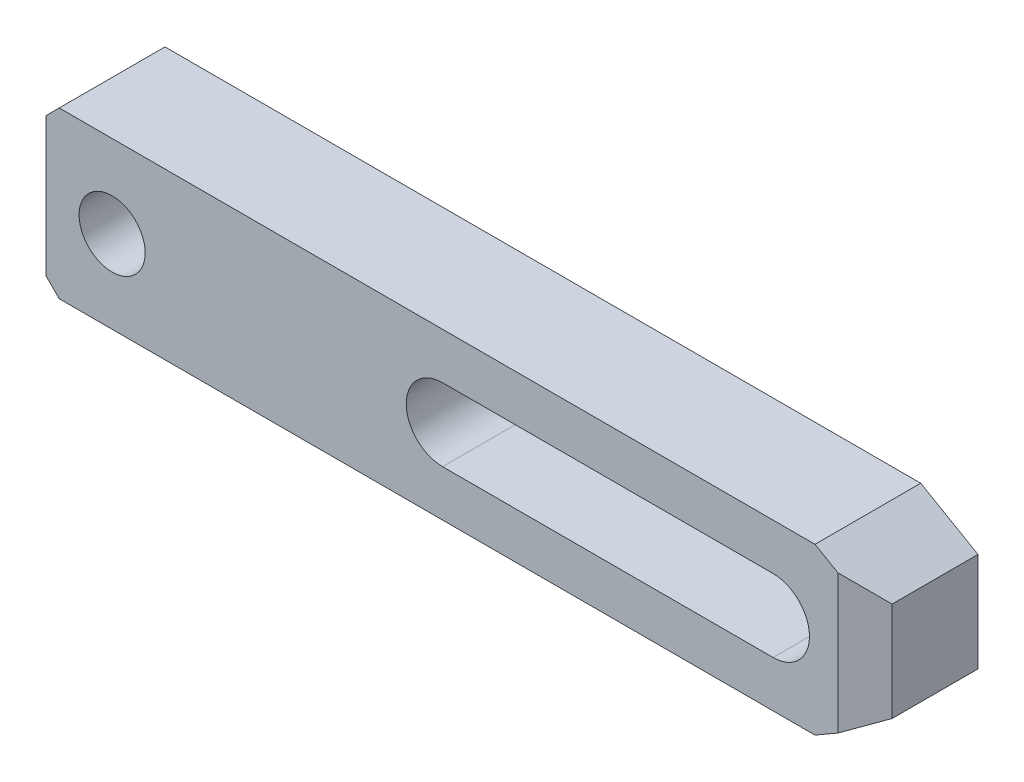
ISO-10303-21;
HEADER;
FILE_DESCRIPTION(('STEP AP214'),'2;1');
FILE_NAME('part.step','',(''),(''),'','','');
FILE_SCHEMA(('AUTOMOTIVE_DESIGN { 1 0 10303 214 1 1 1 1 }'));
ENDSEC;
DATA;
#1=APPLICATION_CONTEXT('core data for automotive mechanical design processes');
#2=APPLICATION_PROTOCOL_DEFINITION('international standard','automotive_design',2000,#1);
#3=PRODUCT_CONTEXT('',#1,'mechanical');
#4=PRODUCT('Part','Part','',(#3));
#5=PRODUCT_RELATED_PRODUCT_CATEGORY('part','',(#4));
#6=PRODUCT_DEFINITION_FORMATION('','',#4);
#7=PRODUCT_DEFINITION_CONTEXT('part definition',#1,'design');
#8=PRODUCT_DEFINITION('design','',#6,#7);
#9=PRODUCT_DEFINITION_SHAPE('','',#8);
#10=(LENGTH_UNIT() NAMED_UNIT(*) SI_UNIT(.MILLI.,.METRE.));
#11=(NAMED_UNIT(*) PLANE_ANGLE_UNIT() SI_UNIT($,.RADIAN.));
#12=(NAMED_UNIT(*) SI_UNIT($,.STERADIAN.) SOLID_ANGLE_UNIT());
#13=UNCERTAINTY_MEASURE_WITH_UNIT(LENGTH_MEASURE(1.E-05),#10,'distance_accuracy_value','');
#14=(GEOMETRIC_REPRESENTATION_CONTEXT(3) GLOBAL_UNCERTAINTY_ASSIGNED_CONTEXT((#13)) GLOBAL_UNIT_ASSIGNED_CONTEXT((#10,
#11,#12)) REPRESENTATION_CONTEXT('',''));
#15=CARTESIAN_POINT('',(0.,0.,0.));
#16=DIRECTION('',(0.,0.,1.));
#17=DIRECTION('',(1.,0.,0.));
#18=AXIS2_PLACEMENT_3D('',#15,#16,#17);
#19=CARTESIAN_POINT('',(-66.1487483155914,54.3512516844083,0.));
#20=DIRECTION('',(0.,0.,1.));
#21=DIRECTION('',(-1.,0.,0.));
#22=AXIS2_PLACEMENT_3D('',#19,#20,#21);
#23=PLANE('',#22);
#24=DIRECTION('',(0.,1.,0.));
#25=VECTOR('',#24,1.);
#26=CARTESIAN_POINT('',(-110.,-10.5,0.));
#27=LINE('',#26,#25);
#28=CARTESIAN_POINT('',(-110.,-10.5,0.));
#29=VERTEX_POINT('',#28);
#30=CARTESIAN_POINT('',(-110.,-5.5,0.));
#31=VERTEX_POINT('',#30);
#32=EDGE_CURVE('E147',#29,#31,#27,.T.);
#33=ORIENTED_EDGE('',*,*,#32,.T.);
#34=DIRECTION('',(-1.,0.,0.));
#35=VECTOR('',#34,1.);
#36=CARTESIAN_POINT('',(0.,-5.5,0.));
#37=LINE('',#36,#35);
#38=CARTESIAN_POINT('',(0.,-5.5,0.));
#39=VERTEX_POINT('',#38);
#40=EDGE_CURVE('E237',#39,#31,#37,.T.);
#41=ORIENTED_EDGE('',*,*,#40,.F.);
#42=CARTESIAN_POINT('',(0.,0.,0.));
#43=DIRECTION('',(0.,0.,1.));
#44=DIRECTION('',(-1.,0.,0.));
#45=AXIS2_PLACEMENT_3D('',#42,#43,#44);
#46=CIRCLE('',#45,5.5);
#47=CARTESIAN_POINT('',(0.,5.5,0.));
#48=VERTEX_POINT('',#47);
#49=EDGE_CURVE('E128',#39,#48,#46,.T.);
#50=ORIENTED_EDGE('',*,*,#49,.T.);
#51=DIRECTION('',(1.,0.,0.));
#52=VECTOR('',#51,1.);
#53=CARTESIAN_POINT('',(-50.,5.5,0.));
#54=LINE('',#53,#52);
#55=CARTESIAN_POINT('',(-110.,5.5,0.));
#56=VERTEX_POINT('',#55);
#57=EDGE_CURVE('E119',#56,#48,#54,.T.);
#58=ORIENTED_EDGE('',*,*,#57,.F.);
#59=CARTESIAN_POINT('',(-110.,10.5,0.));
#60=VERTEX_POINT('',#59);
#61=EDGE_CURVE('E124',#56,#60,#27,.T.);
#62=ORIENTED_EDGE('',*,*,#61,.T.);
#63=DIRECTION('',(-0.70710678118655,-0.707106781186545,0.));
#64=VECTOR('',#63,1.);
#65=CARTESIAN_POINT('',(-108.,12.5,0.));
#66=LINE('',#65,#64);
#67=CARTESIAN_POINT('',(-108.,12.5,0.));
#68=VERTEX_POINT('',#67);
#69=EDGE_CURVE('E148',#68,#60,#66,.T.);
#70=ORIENTED_EDGE('',*,*,#69,.F.);
#71=DIRECTION('',(-1.,0.,0.));
#72=VECTOR('',#71,1.);
#73=CARTESIAN_POINT('',(6.3397459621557,12.5,0.));
#74=LINE('',#73,#72);
#75=CARTESIAN_POINT('',(6.3397459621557,12.5,0.));
#76=VERTEX_POINT('',#75);
#77=EDGE_CURVE('E151',#76,#68,#74,.T.);
#78=ORIENTED_EDGE('',*,*,#77,.F.);
#79=DIRECTION('',(-0.866025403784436,0.5,0.));
#80=VECTOR('',#79,1.);
#81=CARTESIAN_POINT('',(15.,7.5,0.));
#82=LINE('',#81,#80);
#83=CARTESIAN_POINT('',(15.,7.5,0.));
#84=VERTEX_POINT('',#83);
#85=EDGE_CURVE('E158',#84,#76,#82,.T.);
#86=ORIENTED_EDGE('',*,*,#85,.F.);
#87=DIRECTION('',(0.,-1.,0.));
#88=VECTOR('',#87,1.);
#89=CARTESIAN_POINT('',(15.,7.5,0.));
#90=LINE('',#89,#88);
#91=CARTESIAN_POINT('',(15.,-7.5,0.));
#92=VERTEX_POINT('',#91);
#93=EDGE_CURVE('E181',#84,#92,#90,.T.);
#94=ORIENTED_EDGE('',*,*,#93,.T.);
#95=DIRECTION('',(-0.86602540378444,-0.5,0.));
#96=VECTOR('',#95,1.);
#97=CARTESIAN_POINT('',(15.,-7.5,0.));
#98=LINE('',#97,#96);
#99=CARTESIAN_POINT('',(6.33974596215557,-12.5,0.));
#100=VERTEX_POINT('',#99);
#101=EDGE_CURVE('E208',#92,#100,#98,.T.);
#102=ORIENTED_EDGE('',*,*,#101,.T.);
#103=DIRECTION('',(-1.,0.,0.));
#104=VECTOR('',#103,1.);
#105=CARTESIAN_POINT('',(6.33974596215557,-12.5,0.));
#106=LINE('',#105,#104);
#107=CARTESIAN_POINT('',(-108.,-12.5,0.));
#108=VERTEX_POINT('',#107);
#109=EDGE_CURVE('E210',#100,#108,#106,.T.);
#110=ORIENTED_EDGE('',*,*,#109,.T.);
#111=DIRECTION('',(-0.707106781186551,0.707106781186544,0.));
#112=VECTOR('',#111,1.);
#113=CARTESIAN_POINT('',(-108.,-12.5,0.));
#114=LINE('',#113,#112);
#115=EDGE_CURVE('E150',#108,#29,#114,.T.);
#116=ORIENTED_EDGE('',*,*,#115,.T.);
#117=EDGE_LOOP('',(#33,#41,#50,#58,#62,#70,#78,#86,#94,#102,#110,#116));
#118=FACE_BOUND('',#117,.T.);
#119=ADVANCED_FACE('F14',(#118),#23,.F.);
#120=CARTESIAN_POINT('',(-110.,-10.5,16.));
#121=DIRECTION('',(-1.,0.,0.));
#122=DIRECTION('',(0.,0.,-1.));
#123=AXIS2_PLACEMENT_3D('',#120,#121,#122);
#124=PLANE('',#123);
#125=DIRECTION('',(0.,-1.,0.));
#126=VECTOR('',#125,1.);
#127=CARTESIAN_POINT('',(-110.,-10.5,5.));
#128=LINE('',#127,#126);
#129=CARTESIAN_POINT('',(-110.,5.5,5.));
#130=VERTEX_POINT('',#129);
#131=CARTESIAN_POINT('',(-110.,-5.5,5.));
#132=VERTEX_POINT('',#131);
#133=EDGE_CURVE('E141',#130,#132,#128,.T.);
#134=ORIENTED_EDGE('',*,*,#133,.T.);
#135=DIRECTION('',(0.,0.,-1.));
#136=VECTOR('',#135,1.);
#137=CARTESIAN_POINT('',(-110.,-5.5,16.));
#138=LINE('',#137,#136);
#139=EDGE_CURVE('E140',#132,#31,#138,.T.);
#140=ORIENTED_EDGE('',*,*,#139,.T.);
#141=ORIENTED_EDGE('',*,*,#32,.F.);
#142=DIRECTION('',(0.,0.,-1.));
#143=VECTOR('',#142,1.);
#144=CARTESIAN_POINT('',(-110.,-10.5,16.));
#145=LINE('',#144,#143);
#146=CARTESIAN_POINT('',(-110.,-10.5,16.));
#147=VERTEX_POINT('',#146);
#148=EDGE_CURVE('E189',#147,#29,#145,.T.);
#149=ORIENTED_EDGE('',*,*,#148,.F.);
#150=DIRECTION('',(0.,1.,0.));
#151=VECTOR('',#150,1.);
#152=CARTESIAN_POINT('',(-110.,-10.5,16.));
#153=LINE('',#152,#151);
#154=CARTESIAN_POINT('',(-110.,10.5,16.));
#155=VERTEX_POINT('',#154);
#156=EDGE_CURVE('E171',#147,#155,#153,.T.);
#157=ORIENTED_EDGE('',*,*,#156,.T.);
#158=DIRECTION('',(0.,0.,-1.));
#159=VECTOR('',#158,1.);
#160=CARTESIAN_POINT('',(-110.,10.5,16.));
#161=LINE('',#160,#159);
#162=EDGE_CURVE('E145',#155,#60,#161,.T.);
#163=ORIENTED_EDGE('',*,*,#162,.T.);
#164=ORIENTED_EDGE('',*,*,#61,.F.);
#165=DIRECTION('',(0.,0.,-1.));
#166=VECTOR('',#165,1.);
#167=CARTESIAN_POINT('',(-110.,5.5,16.));
#168=LINE('',#167,#166);
#169=EDGE_CURVE('E135',#130,#56,#168,.T.);
#170=ORIENTED_EDGE('',*,*,#169,.F.);
#171=EDGE_LOOP('',(#134,#140,#141,#149,#157,#163,#164,#170));
#172=FACE_BOUND('',#171,.T.);
#173=ADVANCED_FACE('F143',(#172),#124,.T.);
#174=CARTESIAN_POINT('',(-100.,0.,16.));
#175=DIRECTION('',(0.,0.,-1.));
#176=DIRECTION('',(1.,0.,0.));
#177=AXIS2_PLACEMENT_3D('',#174,#175,#176);
#178=CYLINDRICAL_SURFACE('',#177,5.);
#179=CARTESIAN_POINT('',(-100.,0.,16.));
#180=DIRECTION('',(0.,0.,1.));
#181=DIRECTION('',(-1.,0.,0.));
#182=AXIS2_PLACEMENT_3D('',#179,#180,#181);
#183=CIRCLE('',#182,5.);
#184=CARTESIAN_POINT('',(-105.,0.,16.));
#185=VERTEX_POINT('',#184);
#186=EDGE_CURVE('E161',#185,#185,#183,.T.);
#187=ORIENTED_EDGE('',*,*,#186,.T.);
#188=EDGE_LOOP('',(#187));
#189=FACE_BOUND('',#188,.T.);
#190=CARTESIAN_POINT('',(-100.,0.,5.));
#191=DIRECTION('',(0.,0.,-1.));
#192=DIRECTION('',(1.,0.,0.));
#193=AXIS2_PLACEMENT_3D('',#190,#191,#192);
#194=CIRCLE('',#193,5.);
#195=CARTESIAN_POINT('',(-95.,0.,5.));
#196=VERTEX_POINT('',#195);
#197=EDGE_CURVE('E425',#196,#196,#194,.T.);
#198=ORIENTED_EDGE('',*,*,#197,.T.);
#199=EDGE_LOOP('',(#198));
#200=FACE_BOUND('',#199,.T.);
#201=ADVANCED_FACE('F262',(#189,#200),#178,.F.);
#202=CARTESIAN_POINT('',(-50.,0.,16.));
#203=DIRECTION('',(0.,0.,-1.));
#204=DIRECTION('',(1.,0.,0.));
#205=AXIS2_PLACEMENT_3D('',#202,#203,#204);
#206=CYLINDRICAL_SURFACE('',#205,5.5);
#207=DIRECTION('',(0.,0.,-1.));
#208=VECTOR('',#207,1.);
#209=CARTESIAN_POINT('',(-50.,-5.5,16.));
#210=LINE('',#209,#208);
#211=CARTESIAN_POINT('',(-50.,-5.5,16.));
#212=VERTEX_POINT('',#211);
#213=CARTESIAN_POINT('',(-50.,-5.5,5.));
#214=VERTEX_POINT('',#213);
#215=EDGE_CURVE('E256',#212,#214,#210,.T.);
#216=ORIENTED_EDGE('',*,*,#215,.T.);
#217=CARTESIAN_POINT('',(-50.,0.,5.));
#218=DIRECTION('',(0.,0.,-1.));
#219=DIRECTION('',(1.,0.,0.));
#220=AXIS2_PLACEMENT_3D('',#217,#218,#219);
#221=CIRCLE('',#220,5.5);
#222=CARTESIAN_POINT('',(-50.,5.5,5.));
#223=VERTEX_POINT('',#222);
#224=EDGE_CURVE('E278',#214,#223,#221,.T.);
#225=ORIENTED_EDGE('',*,*,#224,.T.);
#226=DIRECTION('',(0.,0.,-1.));
#227=VECTOR('',#226,1.);
#228=CARTESIAN_POINT('',(-50.,5.5,16.));
#229=LINE('',#228,#227);
#230=CARTESIAN_POINT('',(-50.,5.5,16.));
#231=VERTEX_POINT('',#230);
#232=EDGE_CURVE('E244',#231,#223,#229,.T.);
#233=ORIENTED_EDGE('',*,*,#232,.F.);
#234=CARTESIAN_POINT('',(-50.,0.,16.));
#235=DIRECTION('',(0.,0.,1.));
#236=DIRECTION('',(-1.,0.,0.));
#237=AXIS2_PLACEMENT_3D('',#234,#235,#236);
#238=CIRCLE('',#237,5.5);
#239=EDGE_CURVE('E132',#231,#212,#238,.T.);
#240=ORIENTED_EDGE('',*,*,#239,.T.);
#241=EDGE_LOOP('',(#216,#225,#233,#240));
#242=FACE_BOUND('',#241,.T.);
#243=ADVANCED_FACE('F269',(#242),#206,.F.);
#244=CARTESIAN_POINT('',(-66.1487483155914,54.3512516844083,16.));
#245=DIRECTION('',(0.,0.,1.));
#246=DIRECTION('',(-1.,0.,0.));
#247=AXIS2_PLACEMENT_3D('',#244,#245,#246);
#248=PLANE('',#247);
#249=DIRECTION('',(0.,-1.,0.));
#250=VECTOR('',#249,1.);
#251=CARTESIAN_POINT('',(9.80384757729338,54.3512516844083,16.));
#252=LINE('',#251,#250);
#253=CARTESIAN_POINT('',(9.80384757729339,10.5,16.));
#254=VERTEX_POINT('',#253);
#255=CARTESIAN_POINT('',(9.80384757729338,-10.5,16.));
#256=VERTEX_POINT('',#255);
#257=EDGE_CURVE('E233',#254,#256,#252,.T.);
#258=ORIENTED_EDGE('',*,*,#257,.F.);
#259=DIRECTION('',(-0.866025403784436,0.5,0.));
#260=VECTOR('',#259,1.);
#261=CARTESIAN_POINT('',(15.,7.5,16.));
#262=LINE('',#261,#260);
#263=CARTESIAN_POINT('',(6.3397459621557,12.5,16.));
#264=VERTEX_POINT('',#263);
#265=EDGE_CURVE('E179',#254,#264,#262,.T.);
#266=ORIENTED_EDGE('',*,*,#265,.T.);
#267=DIRECTION('',(-1.,0.,0.));
#268=VECTOR('',#267,1.);
#269=CARTESIAN_POINT('',(6.3397459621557,12.5,16.));
#270=LINE('',#269,#268);
#271=CARTESIAN_POINT('',(-108.,12.5,16.));
#272=VERTEX_POINT('',#271);
#273=EDGE_CURVE('E176',#264,#272,#270,.T.);
#274=ORIENTED_EDGE('',*,*,#273,.T.);
#275=DIRECTION('',(-0.70710678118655,-0.707106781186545,0.));
#276=VECTOR('',#275,1.);
#277=CARTESIAN_POINT('',(-108.,12.5,16.));
#278=LINE('',#277,#276);
#279=EDGE_CURVE('E173',#272,#155,#278,.T.);
#280=ORIENTED_EDGE('',*,*,#279,.T.);
#281=ORIENTED_EDGE('',*,*,#156,.F.);
#282=DIRECTION('',(-0.707106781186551,0.707106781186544,0.));
#283=VECTOR('',#282,1.);
#284=CARTESIAN_POINT('',(-108.,-12.5,16.));
#285=LINE('',#284,#283);
#286=CARTESIAN_POINT('',(-108.,-12.5,16.));
#287=VERTEX_POINT('',#286);
#288=EDGE_CURVE('E168',#287,#147,#285,.T.);
#289=ORIENTED_EDGE('',*,*,#288,.F.);
#290=DIRECTION('',(-1.,0.,0.));
#291=VECTOR('',#290,1.);
#292=CARTESIAN_POINT('',(6.33974596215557,-12.5,16.));
#293=LINE('',#292,#291);
#294=CARTESIAN_POINT('',(6.33974596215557,-12.5,16.));
#295=VERTEX_POINT('',#294);
#296=EDGE_CURVE('E165',#295,#287,#293,.T.);
#297=ORIENTED_EDGE('',*,*,#296,.F.);
#298=DIRECTION('',(-0.86602540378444,-0.5,0.));
#299=VECTOR('',#298,1.);
#300=CARTESIAN_POINT('',(15.,-7.5,16.));
#301=LINE('',#300,#299);
#302=EDGE_CURVE('E162',#256,#295,#301,.T.);
#303=ORIENTED_EDGE('',*,*,#302,.F.);
#304=EDGE_LOOP('',(#258,#266,#274,#280,#281,#289,#297,#303));
#305=FACE_BOUND('',#304,.T.);
#306=ORIENTED_EDGE('',*,*,#186,.F.);
#307=EDGE_LOOP('',(#306));
#308=FACE_BOUND('',#307,.T.);
#309=DIRECTION('',(-1.,0.,0.));
#310=VECTOR('',#309,1.);
#311=CARTESIAN_POINT('',(0.,-5.5,16.));
#312=LINE('',#311,#310);
#313=CARTESIAN_POINT('',(0.,-5.5,16.));
#314=VERTEX_POINT('',#313);
#315=EDGE_CURVE('E247',#314,#212,#312,.T.);
#316=ORIENTED_EDGE('',*,*,#315,.T.);
#317=ORIENTED_EDGE('',*,*,#239,.F.);
#318=DIRECTION('',(1.,0.,0.));
#319=VECTOR('',#318,1.);
#320=CARTESIAN_POINT('',(-50.,5.5,16.));
#321=LINE('',#320,#319);
#322=CARTESIAN_POINT('',(0.,5.5,16.));
#323=VERTEX_POINT('',#322);
#324=EDGE_CURVE('E241',#231,#323,#321,.T.);
#325=ORIENTED_EDGE('',*,*,#324,.T.);
#326=CARTESIAN_POINT('',(0.,0.,16.));
#327=DIRECTION('',(0.,0.,1.));
#328=DIRECTION('',(-1.,0.,0.));
#329=AXIS2_PLACEMENT_3D('',#326,#327,#328);
#330=CIRCLE('',#329,5.5);
#331=EDGE_CURVE('E245',#314,#323,#330,.T.);
#332=ORIENTED_EDGE('',*,*,#331,.F.);
#333=EDGE_LOOP('',(#316,#317,#325,#332));
#334=FACE_BOUND('',#333,.T.);
#335=ADVANCED_FACE('F265',(#305,#308,#334),#248,.T.);
#336=CARTESIAN_POINT('',(15.,7.5,16.));
#337=DIRECTION('',(-0.5,-0.866025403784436,0.));
#338=DIRECTION('',(0.866025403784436,-0.5,0.));
#339=AXIS2_PLACEMENT_3D('',#336,#337,#338);
#340=PLANE('',#339);
#341=ORIENTED_EDGE('',*,*,#265,.F.);
#342=DIRECTION('',(0.774596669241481,-0.447213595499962,-0.447213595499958));
#343=VECTOR('',#342,1.);
#344=CARTESIAN_POINT('',(13.9607695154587,8.1,13.6));
#345=LINE('',#344,#343);
#346=CARTESIAN_POINT('',(15.,7.5,13.));
#347=VERTEX_POINT('',#346);
#348=EDGE_CURVE('E235',#254,#347,#345,.T.);
#349=ORIENTED_EDGE('',*,*,#348,.T.);
#350=DIRECTION('',(0.,0.,-1.));
#351=VECTOR('',#350,1.);
#352=CARTESIAN_POINT('',(15.,7.5,16.));
#353=LINE('',#352,#351);
#354=EDGE_CURVE('E164',#347,#84,#353,.T.);
#355=ORIENTED_EDGE('',*,*,#354,.T.);
#356=ORIENTED_EDGE('',*,*,#85,.T.);
#357=DIRECTION('',(0.,0.,-1.));
#358=VECTOR('',#357,1.);
#359=CARTESIAN_POINT('',(6.3397459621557,12.5,16.));
#360=LINE('',#359,#358);
#361=EDGE_CURVE('E9',#264,#76,#360,.T.);
#362=ORIENTED_EDGE('',*,*,#361,.F.);
#363=EDGE_LOOP('',(#341,#349,#355,#356,#362));
#364=FACE_BOUND('',#363,.T.);
#365=ADVANCED_FACE('F268',(#364),#340,.F.);
#366=CARTESIAN_POINT('',(6.3397459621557,12.5,16.));
#367=DIRECTION('',(0.,-1.,0.));
#368=DIRECTION('',(0.,0.,1.));
#369=AXIS2_PLACEMENT_3D('',#366,#367,#368);
#370=PLANE('',#369);
#371=DIRECTION('',(0.,0.,-1.));
#372=VECTOR('',#371,1.);
#373=CARTESIAN_POINT('',(-108.,12.5,16.));
#374=LINE('',#373,#372);
#375=EDGE_CURVE('E22',#272,#68,#374,.T.);
#376=ORIENTED_EDGE('',*,*,#375,.F.);
#377=ORIENTED_EDGE('',*,*,#273,.F.);
#378=ORIENTED_EDGE('',*,*,#361,.T.);
#379=ORIENTED_EDGE('',*,*,#77,.T.);
#380=EDGE_LOOP('',(#376,#377,#378,#379));
#381=FACE_BOUND('',#380,.T.);
#382=ADVANCED_FACE('F16',(#381),#370,.F.);
#383=CARTESIAN_POINT('',(-108.,12.5,16.));
#384=DIRECTION('',(0.707106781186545,-0.70710678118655,0.));
#385=DIRECTION('',(0.70710678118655,0.707106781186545,0.));
#386=AXIS2_PLACEMENT_3D('',#383,#384,#385);
#387=PLANE('',#386);
#388=ORIENTED_EDGE('',*,*,#162,.F.);
#389=ORIENTED_EDGE('',*,*,#279,.F.);
#390=ORIENTED_EDGE('',*,*,#375,.T.);
#391=ORIENTED_EDGE('',*,*,#69,.T.);
#392=EDGE_LOOP('',(#388,#389,#390,#391));
#393=FACE_BOUND('',#392,.T.);
#394=ADVANCED_FACE('F193',(#393),#387,.F.);
#395=CARTESIAN_POINT('',(-108.,-12.5,16.));
#396=DIRECTION('',(-0.707106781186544,-0.707106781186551,0.));
#397=DIRECTION('',(0.707106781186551,-0.707106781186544,0.));
#398=AXIS2_PLACEMENT_3D('',#395,#396,#397);
#399=PLANE('',#398);
#400=DIRECTION('',(0.,0.,-1.));
#401=VECTOR('',#400,1.);
#402=CARTESIAN_POINT('',(-108.,-12.5,16.));
#403=LINE('',#402,#401);
#404=EDGE_CURVE('E187',#287,#108,#403,.T.);
#405=ORIENTED_EDGE('',*,*,#404,.F.);
#406=ORIENTED_EDGE('',*,*,#288,.T.);
#407=ORIENTED_EDGE('',*,*,#148,.T.);
#408=ORIENTED_EDGE('',*,*,#115,.F.);
#409=EDGE_LOOP('',(#405,#406,#407,#408));
#410=FACE_BOUND('',#409,.T.);
#411=ADVANCED_FACE('F220',(#410),#399,.T.);
#412=CARTESIAN_POINT('',(6.33974596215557,-12.5,16.));
#413=DIRECTION('',(0.,-1.,0.));
#414=DIRECTION('',(0.,0.,1.));
#415=AXIS2_PLACEMENT_3D('',#412,#413,#414);
#416=PLANE('',#415);
#417=DIRECTION('',(0.,0.,-1.));
#418=VECTOR('',#417,1.);
#419=CARTESIAN_POINT('',(6.33974596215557,-12.5,16.));
#420=LINE('',#419,#418);
#421=EDGE_CURVE('E185',#295,#100,#420,.T.);
#422=ORIENTED_EDGE('',*,*,#421,.F.);
#423=ORIENTED_EDGE('',*,*,#296,.T.);
#424=ORIENTED_EDGE('',*,*,#404,.T.);
#425=ORIENTED_EDGE('',*,*,#109,.F.);
#426=EDGE_LOOP('',(#422,#423,#424,#425));
#427=FACE_BOUND('',#426,.T.);
#428=ADVANCED_FACE('F306',(#427),#416,.T.);
#429=CARTESIAN_POINT('',(15.,-7.5,16.));
#430=DIRECTION('',(0.5,-0.86602540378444,0.));
#431=DIRECTION('',(0.86602540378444,0.5,0.));
#432=AXIS2_PLACEMENT_3D('',#429,#430,#431);
#433=PLANE('',#432);
#434=DIRECTION('',(0.774596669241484,0.447213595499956,-0.44721359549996));
#435=VECTOR('',#434,1.);
#436=CARTESIAN_POINT('',(13.9607695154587,-8.1,13.6));
#437=LINE('',#436,#435);
#438=CARTESIAN_POINT('',(15.,-7.5,13.));
#439=VERTEX_POINT('',#438);
#440=EDGE_CURVE('E37',#256,#439,#437,.T.);
#441=ORIENTED_EDGE('',*,*,#440,.F.);
#442=ORIENTED_EDGE('',*,*,#302,.T.);
#443=ORIENTED_EDGE('',*,*,#421,.T.);
#444=ORIENTED_EDGE('',*,*,#101,.F.);
#445=DIRECTION('',(0.,0.,-1.));
#446=VECTOR('',#445,1.);
#447=CARTESIAN_POINT('',(15.,-7.5,16.));
#448=LINE('',#447,#446);
#449=EDGE_CURVE('E183',#439,#92,#448,.T.);
#450=ORIENTED_EDGE('',*,*,#449,.F.);
#451=EDGE_LOOP('',(#441,#442,#443,#444,#450));
#452=FACE_BOUND('',#451,.T.);
#453=ADVANCED_FACE('F303',(#452),#433,.T.);
#454=CARTESIAN_POINT('',(15.,7.5,16.));
#455=DIRECTION('',(1.,0.,0.));
#456=DIRECTION('',(0.,0.,1.));
#457=AXIS2_PLACEMENT_3D('',#454,#455,#456);
#458=PLANE('',#457);
#459=DIRECTION('',(0.,-1.,0.));
#460=VECTOR('',#459,1.);
#461=CARTESIAN_POINT('',(15.,20.,13.));
#462=LINE('',#461,#460);
#463=EDGE_CURVE('E227',#347,#439,#462,.T.);
#464=ORIENTED_EDGE('',*,*,#463,.T.);
#465=ORIENTED_EDGE('',*,*,#449,.T.);
#466=ORIENTED_EDGE('',*,*,#93,.F.);
#467=ORIENTED_EDGE('',*,*,#354,.F.);
#468=EDGE_LOOP('',(#464,#465,#466,#467));
#469=FACE_BOUND('',#468,.T.);
#470=ADVANCED_FACE('F205',(#469),#458,.T.);
#471=CARTESIAN_POINT('',(0.,-5.5,16.));
#472=DIRECTION('',(0.,-1.,0.));
#473=DIRECTION('',(1.,0.,0.));
#474=AXIS2_PLACEMENT_3D('',#471,#472,#473);
#475=PLANE('',#474);
#476=ORIENTED_EDGE('',*,*,#40,.T.);
#477=ORIENTED_EDGE('',*,*,#139,.F.);
#478=DIRECTION('',(1.,0.,0.));
#479=VECTOR('',#478,1.);
#480=CARTESIAN_POINT('',(-115.,-5.5,5.));
#481=LINE('',#480,#479);
#482=EDGE_CURVE('E276',#132,#214,#481,.T.);
#483=ORIENTED_EDGE('',*,*,#482,.T.);
#484=ORIENTED_EDGE('',*,*,#215,.F.);
#485=ORIENTED_EDGE('',*,*,#315,.F.);
#486=DIRECTION('',(0.,0.,-1.));
#487=VECTOR('',#486,1.);
#488=CARTESIAN_POINT('',(0.,-5.5,16.));
#489=LINE('',#488,#487);
#490=EDGE_CURVE('E255',#314,#39,#489,.T.);
#491=ORIENTED_EDGE('',*,*,#490,.T.);
#492=EDGE_LOOP('',(#476,#477,#483,#484,#485,#491));
#493=FACE_BOUND('',#492,.T.);
#494=ADVANCED_FACE('F275',(#493),#475,.F.);
#495=CARTESIAN_POINT('',(0.,0.,16.));
#496=DIRECTION('',(0.,0.,-1.));
#497=DIRECTION('',(1.,0.,0.));
#498=AXIS2_PLACEMENT_3D('',#495,#496,#497);
#499=CYLINDRICAL_SURFACE('',#498,5.5);
#500=DIRECTION('',(0.,0.,-1.));
#501=VECTOR('',#500,1.);
#502=CARTESIAN_POINT('',(0.,5.5,16.));
#503=LINE('',#502,#501);
#504=EDGE_CURVE('E253',#323,#48,#503,.T.);
#505=ORIENTED_EDGE('',*,*,#504,.T.);
#506=ORIENTED_EDGE('',*,*,#49,.F.);
#507=ORIENTED_EDGE('',*,*,#490,.F.);
#508=ORIENTED_EDGE('',*,*,#331,.T.);
#509=EDGE_LOOP('',(#505,#506,#507,#508));
#510=FACE_BOUND('',#509,.T.);
#511=ADVANCED_FACE('F280',(#510),#499,.F.);
#512=CARTESIAN_POINT('',(-50.,5.5,16.));
#513=DIRECTION('',(0.,1.,0.));
#514=DIRECTION('',(0.,0.,-1.));
#515=AXIS2_PLACEMENT_3D('',#512,#513,#514);
#516=PLANE('',#515);
#517=ORIENTED_EDGE('',*,*,#57,.T.);
#518=ORIENTED_EDGE('',*,*,#504,.F.);
#519=ORIENTED_EDGE('',*,*,#324,.F.);
#520=ORIENTED_EDGE('',*,*,#232,.T.);
#521=DIRECTION('',(1.,0.,0.));
#522=VECTOR('',#521,1.);
#523=CARTESIAN_POINT('',(-115.,5.5,5.));
#524=LINE('',#523,#522);
#525=EDGE_CURVE('E29',#130,#223,#524,.T.);
#526=ORIENTED_EDGE('',*,*,#525,.F.);
#527=ORIENTED_EDGE('',*,*,#169,.T.);
#528=EDGE_LOOP('',(#517,#518,#519,#520,#526,#527));
#529=FACE_BOUND('',#528,.T.);
#530=ADVANCED_FACE('F136',(#529),#516,.F.);
#531=CARTESIAN_POINT('',(2.87564434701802,20.,20.));
#532=DIRECTION('',(-0.5,0.,-0.866025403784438));
#533=DIRECTION('',(0.866025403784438,0.,-0.5));
#534=AXIS2_PLACEMENT_3D('',#531,#532,#533);
#535=PLANE('',#534);
#536=ORIENTED_EDGE('',*,*,#257,.T.);
#537=ORIENTED_EDGE('',*,*,#440,.T.);
#538=ORIENTED_EDGE('',*,*,#463,.F.);
#539=ORIENTED_EDGE('',*,*,#348,.F.);
#540=EDGE_LOOP('',(#536,#537,#538,#539));
#541=FACE_BOUND('',#540,.T.);
#542=ADVANCED_FACE('F288',(#541),#535,.F.);
#543=CARTESIAN_POINT('',(-115.,-5.5,5.));
#544=DIRECTION('',(0.,0.,-1.));
#545=DIRECTION('',(1.,0.,0.));
#546=AXIS2_PLACEMENT_3D('',#543,#544,#545);
#547=PLANE('',#546);
#548=ORIENTED_EDGE('',*,*,#197,.F.);
#549=EDGE_LOOP('',(#548));
#550=FACE_BOUND('',#549,.T.);
#551=ORIENTED_EDGE('',*,*,#525,.T.);
#552=ORIENTED_EDGE('',*,*,#224,.F.);
#553=ORIENTED_EDGE('',*,*,#482,.F.);
#554=ORIENTED_EDGE('',*,*,#133,.F.);
#555=EDGE_LOOP('',(#551,#552,#553,#554));
#556=FACE_BOUND('',#555,.T.);
#557=ADVANCED_FACE('F410',(#550,#556),#547,.T.);
#558=CLOSED_SHELL('',(#119,#173,#201,#243,#335,#365,#382,#394,#411,#428,#453,#470,#494,#511,
#530,#542,#557));
#559=MANIFOLD_SOLID_BREP('B1',#558);
#560=ADVANCED_BREP_SHAPE_REPRESENTATION('',(#18,#559),#14);
#561=SHAPE_DEFINITION_REPRESENTATION(#9,#560);
ENDSEC;
END-ISO-10303-21;
